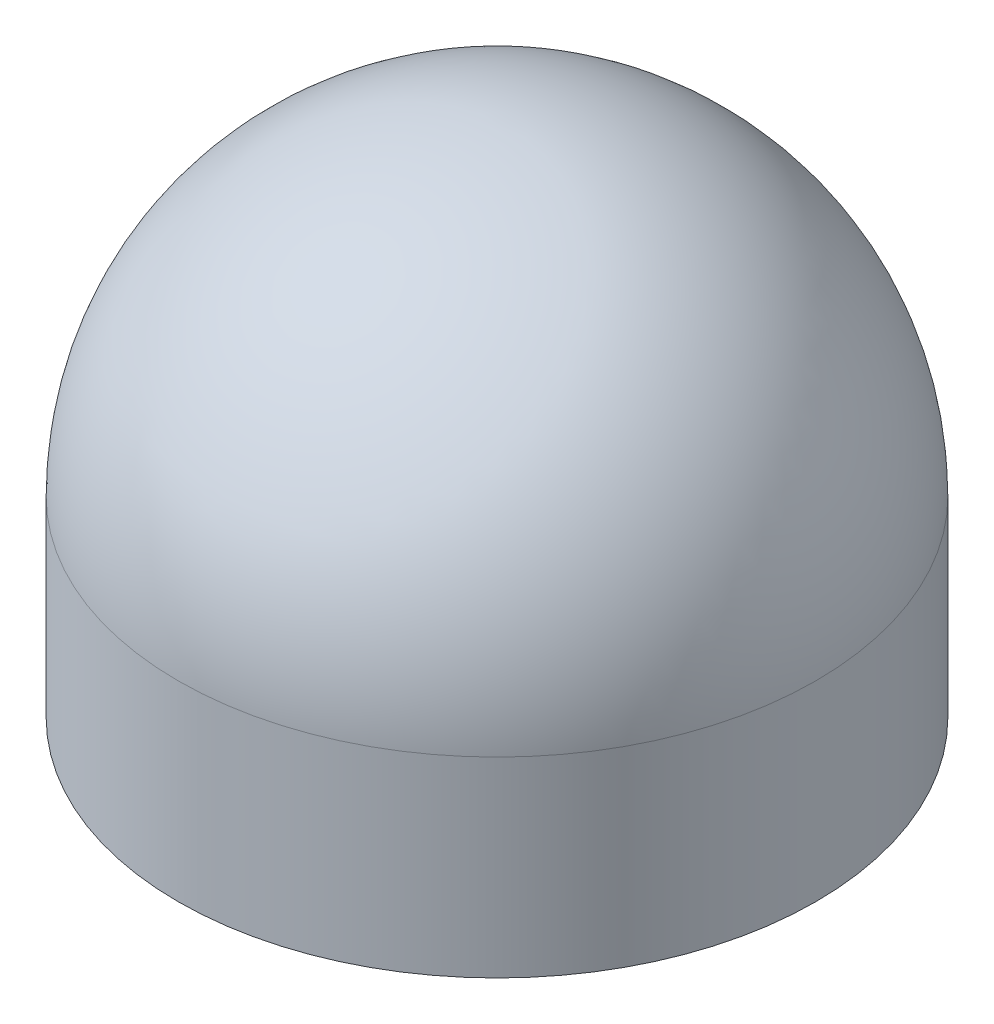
from build123d import *

# Parameters (mm, degrees)
SKETCH1_R           = 50
BOSS_EXTRUDE1_DEPTH = 30
DOME1_FACE_RADIUS   = 50
DOME1_HEIGHT        = 50


with BuildPart() as part:
    # Sketch1 → Boss-Extrude1 (new body)
    with BuildSketch(Plane(origin=(0, 0, 0), x_dir=(1, 0, 0), z_dir=(0, 1, 0))):
        with Locations(Location((0, 0, 0), (0, 0, 270))):
            Circle(SKETCH1_R)
    extrude(amount=BOSS_EXTRUDE1_DEPTH)

    # Dome1: a dome of height H over a round flat face of radius A is a cap of a sphere of radius (A * A + H * H) / (2 * H)
    dome1_r = (DOME1_FACE_RADIUS * DOME1_FACE_RADIUS + DOME1_HEIGHT * DOME1_HEIGHT) / (2 * DOME1_HEIGHT)
    dome1_base = Plane((0, 30, 0), z_dir=(0, 1, 0))
    with Locations(dome1_base.offset(DOME1_HEIGHT - dome1_r)):
        dome1_ball = Sphere(dome1_r, mode=Mode.PRIVATE)
    add(split(dome1_ball, bisect_by=dome1_base, keep=Keep.TOP, mode=Mode.PRIVATE))


solid = part.part
